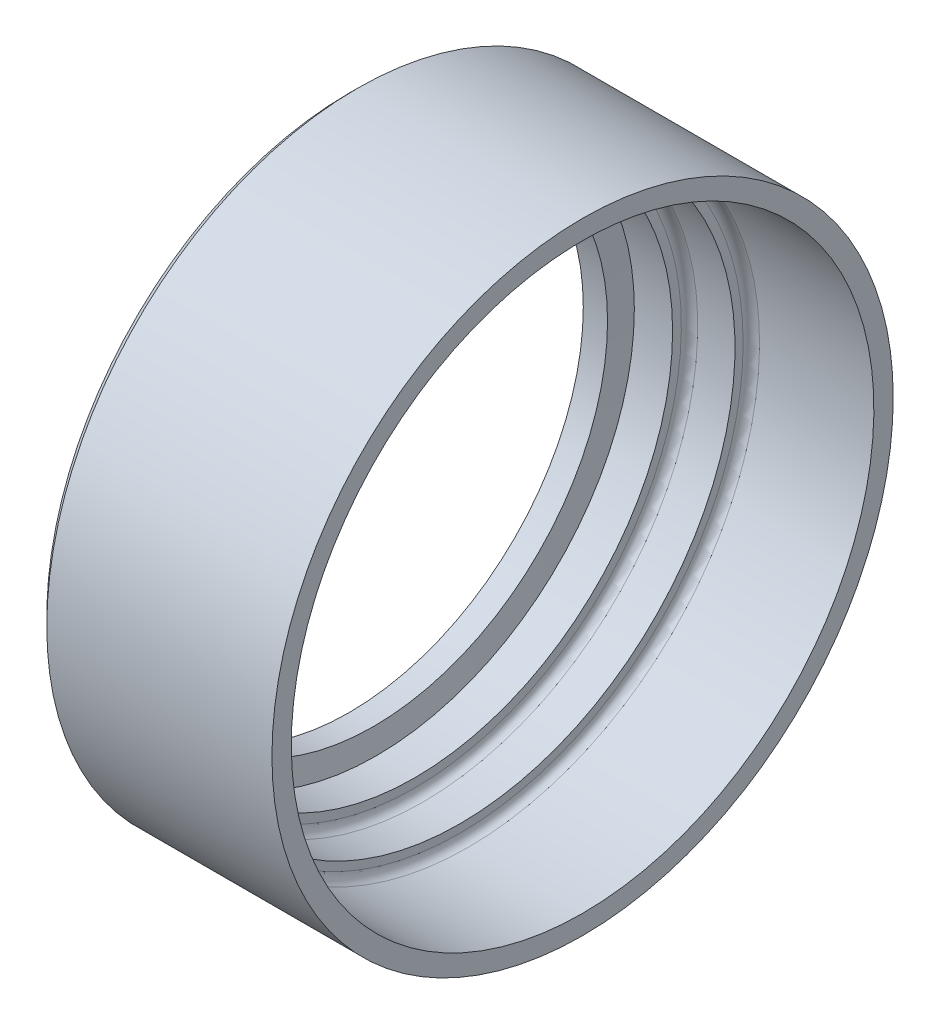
from build123d import *

# Parameters (mm, degrees)
FILLET1_R     = 0.79375
CHAMFER2_SIZE = 0.79375


with BuildPart() as part:
    # Sketch1 → Revolve1 (revolve)
    with BuildSketch(Plane.XY, mode=Mode.PRIVATE) as revolve1_sk:
        Polygon((-278.492477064, 25.025), (-282.202304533, 25.025), (-282.479028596, 22.701776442), (-284.831028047, 22.701776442), (-284.831028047, 30.130565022), (-262.198353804, 30.130565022), (-262.198353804, 28.254838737), (-274.084644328, 28.254838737), (-274.084644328, 26.67), (-278.492477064, 26.67), align=None)
    revolve(revolve1_sk.sketch.rotate(Axis((-283.826295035, 0, 0), (1, 0, 0)), 180), axis=Axis((-283.826295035, 0, 0), (1, 0, 0)))

    # Fillet1
    fillet1_edges = [part.edges().sort_by_distance(p)[0] for p in [
        (-278.492477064, 26.67, 0),
        (-274.084644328, 28.254838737, 0),
    ]]
    fillet(fillet1_edges, radius=FILLET1_R)

    # Chamfer2
    chamfer2_edges = [part.edges().sort_by_distance(p)[0] for p in [
        (-284.831028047, 30.130565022, 0),
    ]]
    chamfer(chamfer2_edges, length=CHAMFER2_SIZE)


solid = part.part
